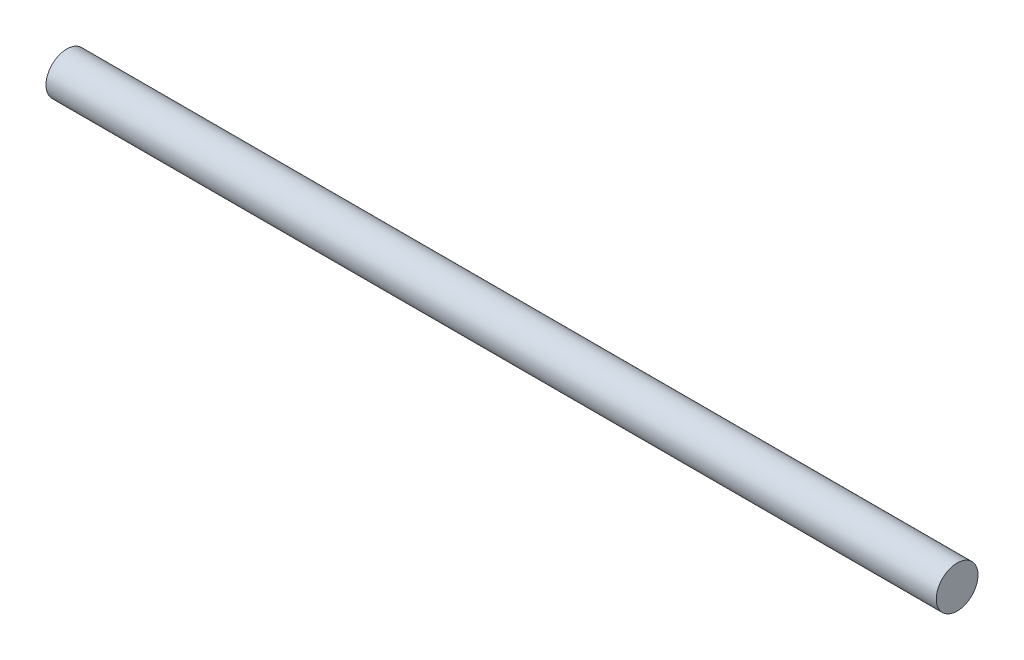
from build123d import *

# Parameters (mm, degrees)
SKETCH1_R      = 4.7625
EXTRUDE1_DEPTH = 203.2


with BuildPart() as part:
    # Sketch1 → Extrude1 (new body)
    with BuildSketch(Plane(origin=(0, 0, 0), x_dir=(0, 0, -1), z_dir=(1, 0, 0))):
        Circle(SKETCH1_R)
    extrude(amount=EXTRUDE1_DEPTH)


solid = part.part
